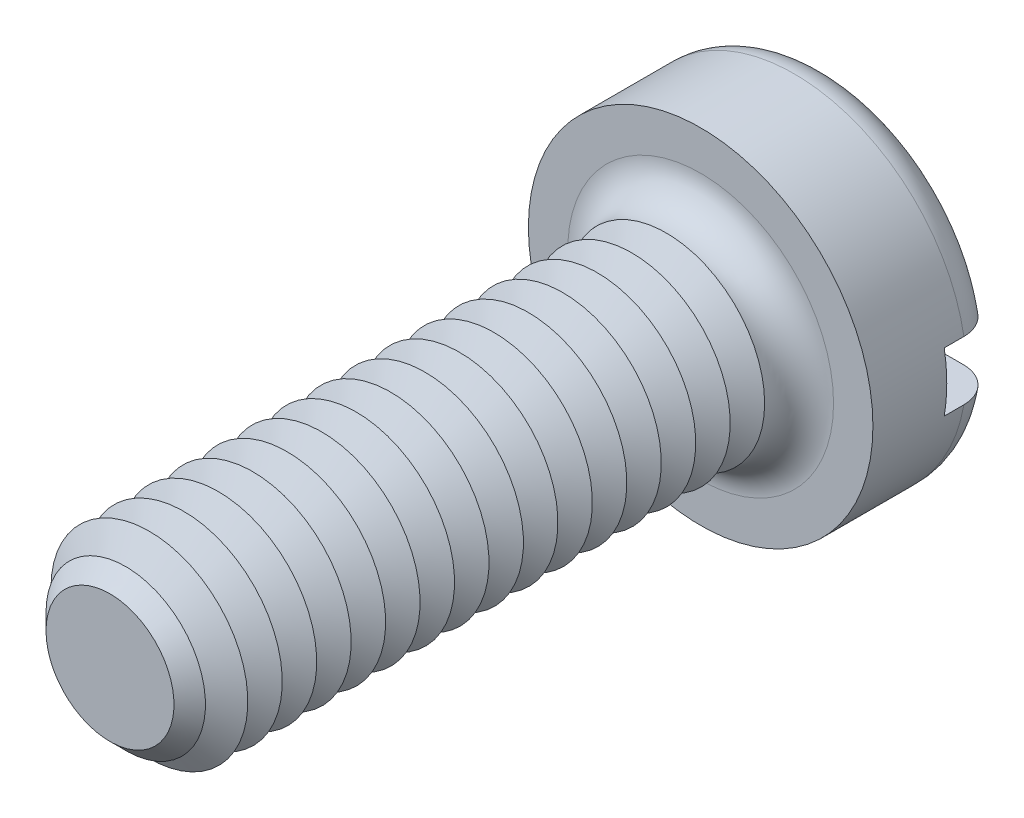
from build123d import *

# Parameters (mm, degrees)
SKETCH3_R           = 3.5
BOSS_EXTRUDE2_DEPTH = 2.6
SKETCH4_R           = 2
BOSS_EXTRUDE3_DEPTH = 12
FILLET1_R           = 0.7
CHAMFER1_SIZE       = 0.7
LPATTERN1_COUNT     = 16
LPATTERN1_PITCH     = 0.7
SKETCH8_W           = 7
SKETCH8_H           = 1.2
CUT_EXTRUDE1_DEPTH  = 1.1


with BuildPart() as part:
    # Sketch3 → Boss-Extrude2 (new body)
    with BuildSketch(Plane.XY):
        Circle(SKETCH3_R)
    extrude(amount=-BOSS_EXTRUDE2_DEPTH)

    # Sketch4 → Boss-Extrude3 (add)
    with BuildSketch(Plane.XY):
        Circle(SKETCH4_R)
    extrude(amount=BOSS_EXTRUDE3_DEPTH)

    # Fillet1
    fillet1_edges = [part.edges().sort_by_distance(p)[0] for p in [
        (-3.5, 0, -2.6),
        (-2, 0, 0),
    ]]
    fillet(fillet1_edges, radius=FILLET1_R)

    # Chamfer1
    chamfer1_edges = [part.edges().sort_by_distance(p)[0] for p in [
        (-2, 0, 12),
    ]]
    chamfer(chamfer1_edges, length=CHAMFER1_SIZE)

    # Sketch6 → Cut-Revolve1 (revolve, cut)
    with BuildSketch(Plane(origin=(0, 0, 0), x_dir=(0, 0, -1), z_dir=(1, 0, 0)), mode=Mode.PRIVATE) as cut_revolve1_sk:
        Polygon((-0.7, 2), (-1.05, 1.393782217), (-1.4, 2), align=None)
    cut_revolve1 = revolve(cut_revolve1_sk.sketch.rotate(Axis((0, 0, -1.694361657), (0, 0, 1)), 90), axis=Axis((0, 0, -1.694361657), (0, 0, 1)), mode=Mode.SUBTRACT)

    # LPattern1: Cut-Revolve1 ×16
    with Locations(*[(0, 0, i * LPATTERN1_PITCH) for i in range(1, LPATTERN1_COUNT)]):
        add(cut_revolve1, mode=Mode.SUBTRACT)

    # Sketch8 → Cut-Extrude1 (cut)
    with BuildSketch(Plane(origin=(0, 0, -2.6), x_dir=(-1, 0, 0), z_dir=(0, 0, -1))):
        Rectangle(SKETCH8_W, SKETCH8_H)
    extrude(amount=-CUT_EXTRUDE1_DEPTH, mode=Mode.SUBTRACT)


solid = part.part
